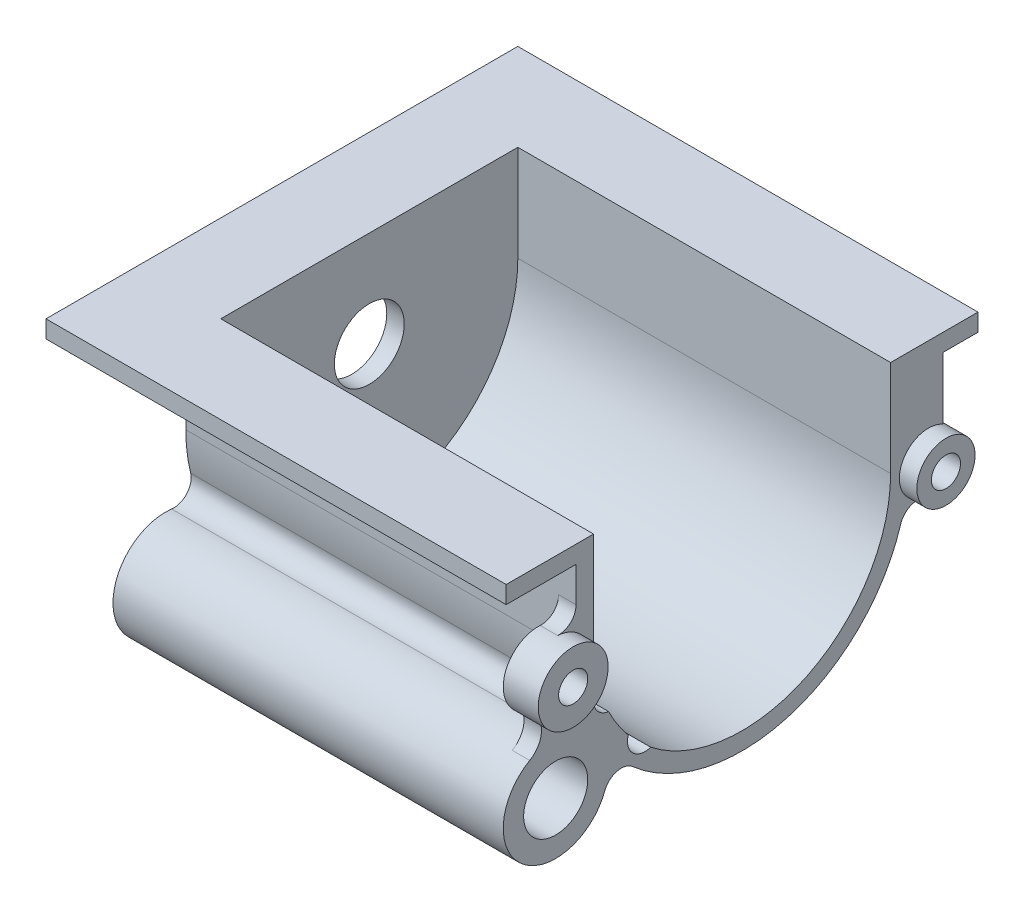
from build123d import *
from build123d.topology import SkipClean

# Parameters (mm, degrees)
EXTRUDE1_DEPTH            = 67
SHELL1_T                  = -3
EXTRUDE2_DEPTH            = 3
EXTRUDE3_START            = -3
EXTRUDE3_DEPTH            = 3
EXTRUDE4_START            = -3
EXTRUDE4_DEPTH            = 3
FILLET1_R                 = 3
SKETCH5_R                 = 5
SKETCH5_R_2               = 6
EXTRUDE5_DEPTH            = 3
EXTRUDE6_START            = 64
EXTRUDE6_DEPTH            = 64
SKETCH7_R                 = 3
CUT_EXTRUDE1_DEPTH        = 64
M5_0_5_DIAMETER_HOLE1_D   = 5
M11_0_11_DIAMETER_HOLE1_D = 11
M12_0_12_DIAMETER_HOLE1_D = 12


with BuildPart() as part:
    # Sketch1 → Extrude1 (new body)
    with BuildSketch(Plane(origin=(0, 0, 0), x_dir=(0, 0, -1), z_dir=(1, 0, 0))):
        with BuildLine():
            Line((28.5, 0), (28.5, 16.5))
            Line((28.5, 16.5), (-28.5, 16.5))
            Line((-28.5, 16.5), (-28.5, 0))
            ThreePointArc((-28.5, 0), (0, -28.5), (28.5, 0))
        make_face()
    extrude(amount=EXTRUDE1_DEPTH)

    # Shell1
    shell1_openings = [part.faces().sort_by_distance(p)[0] for p in [
        (67, -3.46223453, 0),
        (33.5, 16.5, 0),
    ]]
    offset(amount=SHELL1_T, openings=shell1_openings, kind=Kind.INTERSECTION)

    # Sketch2 → Extrude2 (add)
    with BuildSketch(Plane(origin=(0, 16.5, 0), x_dir=(-1, 0, 0), z_dir=(0, 1, 0))):
        Polygon((-67, -25.5), (-67, -40.5), (12, -40.5), (12, 40.5), (-67, 40.5), (-67, 25.5), (-3, 25.5), (-3, -25.5), align=None)
    extrude(amount=-EXTRUDE2_DEPTH)

    # Sketch3 → Extrude3 (add)
    with BuildSketch(Plane(origin=(67, 0, 0), x_dir=(0, 0, -1), z_dir=(1, 0, 0)).offset(EXTRUDE3_START)):
        with BuildLine():
            Line((-28.5, 3.373397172), (-28.5, 0))
            ThreePointArc((-28.5, 0), (-27.356467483, -7.992101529), (-24.017636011, -15.342853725))
            ThreePointArc((-24.017636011, -15.342853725), (-34.539846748, -28.134186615), (-36.459969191, -11.682796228))
            ThreePointArc((-36.459969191, -11.682796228), (-34.692778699, -9.602042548), (-34.671987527, -6.872195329))
            ThreePointArc((-34.671987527, -6.872195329), (-37.139498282, 1.596055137), (-28.5, 3.373397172))
        make_face()
    extrude(amount=EXTRUDE3_DEPTH)

    # Sketch4 → Extrude4 (add)
    with BuildSketch(Plane(origin=(67, 0, 0), x_dir=(0, 0, -1), z_dir=(1, 0, 0)).offset(EXTRUDE4_START)):
        with BuildLine():
            Line((34.5, 2.830127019), (34.5, 13.5))
            Line((34.5, 13.5), (28.5, 13.5))
            Line((28.5, 13.5), (28.5, 0))
            ThreePointArc((28.5, 0), (28.404318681, -2.333383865), (28.117917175, -4.651100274))
            ThreePointArc((28.117917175, -4.651100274), (35.803909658, -4.745037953), (34.5, 2.830127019))
        make_face()
    extrude(amount=EXTRUDE4_DEPTH)

    # Fillet1
    fillet1_edges = [part.edges().sort_by_distance(p)[0] for p in [
        (65.5, -15.342853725, 24.017636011),
        (65.5, 3.373397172, 28.5),
        (65.5, -4.651100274, -28.117917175),
    ]]
    fillet(fillet1_edges, radius=FILLET1_R)

    # Sketch5 → Extrude5 (add)
    with SkipClean():  # the faces are left unmerged after this step: merging them gives an invalid solid
        with BuildSketch(Plane(origin=(67, 0, 0), x_dir=(0, 0, -1), z_dir=(1, 0, 0))):
            with Locations((32, -1.5)):
                Circle(SKETCH5_R)
            with Locations((-32, -1.5)):
                Circle(SKETCH5_R_2)
        extrude(amount=EXTRUDE5_DEPTH)

    # Sketch6 → Extrude6 (add)
    with BuildSketch(Plane.ZY.offset(-64).offset(EXTRUDE6_START)):
        with BuildLine():
            ThreePointArc((23.567577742, -22.645513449), (21.490755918, -20.785192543), (18.779935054, -21.437444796))
            ThreePointArc((18.779935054, -21.437444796), (24.337312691, -14.830549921), (27.661395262, -6.862740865))
            ThreePointArc((27.661395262, -6.862740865), (28.324439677, -9.570942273), (30.929840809, -10.56385098))
            ThreePointArc((30.929840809, -10.56385098), (39.685467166, -24.183331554), (23.567577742, -22.645513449))
        make_face()
    extrude(amount=-EXTRUDE6_DEPTH)

    # Sketch7 → Cut-Extrude1 (cut)
    with BuildSketch(Plane(origin=(67, 0, 0), x_dir=(0, 0, -1), z_dir=(1, 0, 0))):
        with Locations((-22.552622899, -8.20848344)):
            Circle(SKETCH7_R)
        with Locations((-16.671800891, -17.264155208)):
            Circle(SKETCH7_R)
    extrude(amount=-CUT_EXTRUDE1_DEPTH, mode=Mode.SUBTRACT)

    # M5.0 _5_ Diameter Hole1 (through all)
    with Locations(Plane(origin=(70, 0, 0), x_dir=(0, 0, -1), z_dir=(1, 0, 0))):
        with Locations((-32, -1.5), (32, -1.5)):
            Hole(M5_0_5_DIAMETER_HOLE1_D / 2)

    # M11.0 _11_ Diameter Hole1 (through all)
    with Locations(Plane(origin=(67, 0, 0), x_dir=(0, 0, -1), z_dir=(1, 0, 0))):
        with Locations((-32, -19.5)):
            Hole(M11_0_11_DIAMETER_HOLE1_D / 2)

    # M12.0 _12_ Diameter Hole1 (through all)
    with Locations(Plane(origin=(3, 0, 0), x_dir=(0, 0, -1), z_dir=(1, 0, 0))):
        with Locations((0, 0)):
            Hole(M12_0_12_DIAMETER_HOLE1_D / 2)


solid = part.part
